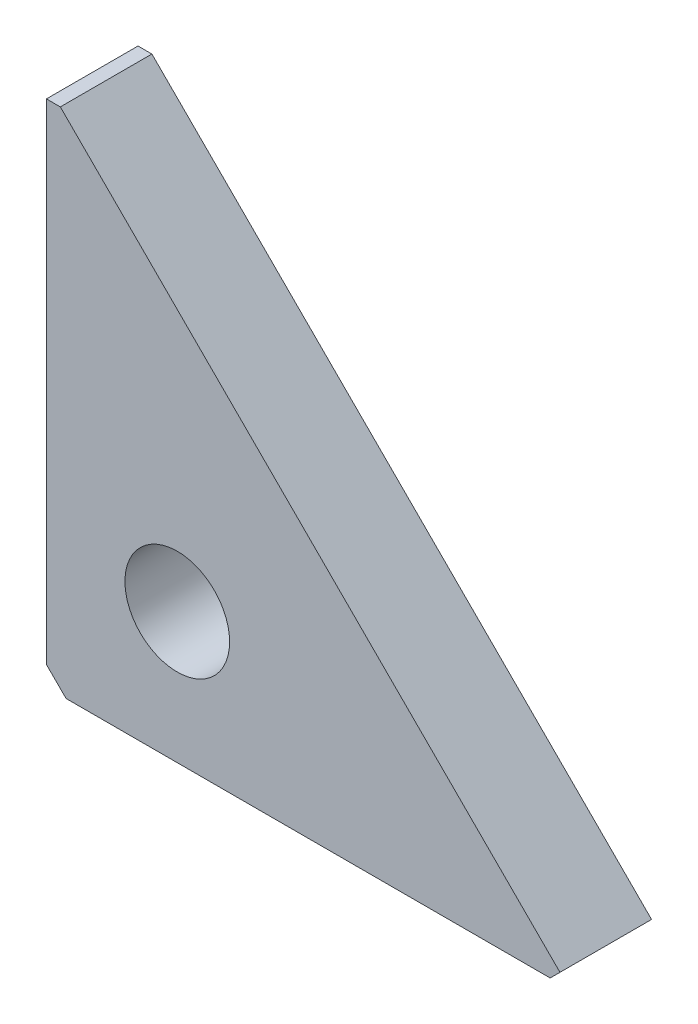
ISO-10303-21;
HEADER;
FILE_DESCRIPTION(('STEP AP214'),'2;1');
FILE_NAME('part.step','',(''),(''),'','','');
FILE_SCHEMA(('AUTOMOTIVE_DESIGN { 1 0 10303 214 1 1 1 1 }'));
ENDSEC;
DATA;
#1=APPLICATION_CONTEXT('core data for automotive mechanical design processes');
#2=APPLICATION_PROTOCOL_DEFINITION('international standard','automotive_design',2000,#1);
#3=PRODUCT_CONTEXT('',#1,'mechanical');
#4=PRODUCT('Part','Part','',(#3));
#5=PRODUCT_RELATED_PRODUCT_CATEGORY('part','',(#4));
#6=PRODUCT_DEFINITION_FORMATION('','',#4);
#7=PRODUCT_DEFINITION_CONTEXT('part definition',#1,'design');
#8=PRODUCT_DEFINITION('design','',#6,#7);
#9=PRODUCT_DEFINITION_SHAPE('','',#8);
#10=(LENGTH_UNIT() NAMED_UNIT(*) SI_UNIT(.MILLI.,.METRE.));
#11=(NAMED_UNIT(*) PLANE_ANGLE_UNIT() SI_UNIT($,.RADIAN.));
#12=(NAMED_UNIT(*) SI_UNIT($,.STERADIAN.) SOLID_ANGLE_UNIT());
#13=UNCERTAINTY_MEASURE_WITH_UNIT(LENGTH_MEASURE(1.E-05),#10,'distance_accuracy_value','');
#14=(GEOMETRIC_REPRESENTATION_CONTEXT(3) GLOBAL_UNCERTAINTY_ASSIGNED_CONTEXT((#13)) GLOBAL_UNIT_ASSIGNED_CONTEXT((#10,
#11,#12)) REPRESENTATION_CONTEXT('',''));
#15=CARTESIAN_POINT('',(0.,0.,0.));
#16=DIRECTION('',(0.,0.,1.));
#17=DIRECTION('',(1.,0.,0.));
#18=AXIS2_PLACEMENT_3D('',#15,#16,#17);
#19=CARTESIAN_POINT('',(80.,-80.,14.));
#20=DIRECTION('',(-0.707106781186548,-0.707106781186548,0.));
#21=DIRECTION('',(0.707106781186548,-0.707106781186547,0.));
#22=AXIS2_PLACEMENT_3D('',#19,#20,#21);
#23=PLANE('',#22);
#24=DIRECTION('',(-0.707106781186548,0.707106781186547,0.));
#25=VECTOR('',#24,1.);
#26=CARTESIAN_POINT('',(80.,-80.,14.));
#27=LINE('',#26,#25);
#28=CARTESIAN_POINT('',(78.5,-78.5,14.));
#29=VERTEX_POINT('',#28);
#30=CARTESIAN_POINT('',(2.12132034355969,-2.12132034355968,14.));
#31=VERTEX_POINT('',#30);
#32=EDGE_CURVE('E113',#29,#31,#27,.T.);
#33=ORIENTED_EDGE('',*,*,#32,.F.);
#34=DIRECTION('',(0.,0.,-1.));
#35=VECTOR('',#34,1.);
#36=CARTESIAN_POINT('',(78.5,-78.5,14.));
#37=LINE('',#36,#35);
#38=CARTESIAN_POINT('',(78.5,-78.5,0.));
#39=VERTEX_POINT('',#38);
#40=EDGE_CURVE('E11',#29,#39,#37,.T.);
#41=ORIENTED_EDGE('',*,*,#40,.T.);
#42=DIRECTION('',(-0.707106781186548,0.707106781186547,0.));
#43=VECTOR('',#42,1.);
#44=CARTESIAN_POINT('',(80.,-80.,0.));
#45=LINE('',#44,#43);
#46=CARTESIAN_POINT('',(2.12132034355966,-2.12132034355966,0.));
#47=VERTEX_POINT('',#46);
#48=EDGE_CURVE('E118',#39,#47,#45,.T.);
#49=ORIENTED_EDGE('',*,*,#48,.T.);
#50=DIRECTION('',(0.,0.,1.));
#51=VECTOR('',#50,1.);
#52=CARTESIAN_POINT('',(2.12132034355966,-2.12132034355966,14.));
#53=LINE('',#52,#51);
#54=EDGE_CURVE('E42',#47,#31,#53,.T.);
#55=ORIENTED_EDGE('',*,*,#54,.T.);
#56=EDGE_LOOP('',(#33,#41,#49,#55));
#57=FACE_BOUND('',#56,.T.);
#58=ADVANCED_FACE('F34',(#57),#23,.F.);
#59=CARTESIAN_POINT('',(0.,0.,14.));
#60=DIRECTION('',(1.,0.,0.));
#61=DIRECTION('',(0.,1.,0.));
#62=AXIS2_PLACEMENT_3D('',#59,#60,#61);
#63=PLANE('',#62);
#64=DIRECTION('',(0.,-1.,0.));
#65=VECTOR('',#64,1.);
#66=CARTESIAN_POINT('',(0.,0.,0.));
#67=LINE('',#66,#65);
#68=CARTESIAN_POINT('',(0.,-2.12132034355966,0.));
#69=VERTEX_POINT('',#68);
#70=CARTESIAN_POINT('',(0.,-77.,0.));
#71=VERTEX_POINT('',#70);
#72=EDGE_CURVE('E114',#69,#71,#67,.T.);
#73=ORIENTED_EDGE('',*,*,#72,.T.);
#74=DIRECTION('',(0.,0.,1.));
#75=VECTOR('',#74,1.);
#76=CARTESIAN_POINT('',(0.,-77.,14.));
#77=LINE('',#76,#75);
#78=CARTESIAN_POINT('',(0.,-77.,14.));
#79=VERTEX_POINT('',#78);
#80=EDGE_CURVE('E93',#71,#79,#77,.T.);
#81=ORIENTED_EDGE('',*,*,#80,.T.);
#82=DIRECTION('',(0.,-1.,0.));
#83=VECTOR('',#82,1.);
#84=CARTESIAN_POINT('',(0.,0.,14.));
#85=LINE('',#84,#83);
#86=CARTESIAN_POINT('',(0.,-2.12132034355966,14.));
#87=VERTEX_POINT('',#86);
#88=EDGE_CURVE('E116',#87,#79,#85,.T.);
#89=ORIENTED_EDGE('',*,*,#88,.F.);
#90=DIRECTION('',(0.,0.,-1.));
#91=VECTOR('',#90,1.);
#92=CARTESIAN_POINT('',(0.,-2.12132034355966,14.));
#93=LINE('',#92,#91);
#94=EDGE_CURVE('E98',#87,#69,#93,.T.);
#95=ORIENTED_EDGE('',*,*,#94,.T.);
#96=EDGE_LOOP('',(#73,#81,#89,#95));
#97=FACE_BOUND('',#96,.T.);
#98=ADVANCED_FACE('F159',(#97),#63,.F.);
#99=CARTESIAN_POINT('',(0.,-80.,14.));
#100=DIRECTION('',(0.,1.,0.));
#101=DIRECTION('',(0.,0.,1.));
#102=AXIS2_PLACEMENT_3D('',#99,#100,#101);
#103=PLANE('',#102);
#104=DIRECTION('',(1.,0.,0.));
#105=VECTOR('',#104,1.);
#106=CARTESIAN_POINT('',(0.,-80.,14.));
#107=LINE('',#106,#105);
#108=CARTESIAN_POINT('',(3.00000000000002,-80.,14.));
#109=VERTEX_POINT('',#108);
#110=CARTESIAN_POINT('',(77.,-80.,14.));
#111=VERTEX_POINT('',#110);
#112=EDGE_CURVE('E107',#109,#111,#107,.T.);
#113=ORIENTED_EDGE('',*,*,#112,.F.);
#114=DIRECTION('',(0.,0.,-1.));
#115=VECTOR('',#114,1.);
#116=CARTESIAN_POINT('',(3.,-80.,14.));
#117=LINE('',#116,#115);
#118=CARTESIAN_POINT('',(3.,-80.,0.));
#119=VERTEX_POINT('',#118);
#120=EDGE_CURVE('E92',#109,#119,#117,.T.);
#121=ORIENTED_EDGE('',*,*,#120,.T.);
#122=DIRECTION('',(1.,0.,0.));
#123=VECTOR('',#122,1.);
#124=CARTESIAN_POINT('',(0.,-80.,0.));
#125=LINE('',#124,#123);
#126=CARTESIAN_POINT('',(77.,-80.,0.));
#127=VERTEX_POINT('',#126);
#128=EDGE_CURVE('E105',#119,#127,#125,.T.);
#129=ORIENTED_EDGE('',*,*,#128,.T.);
#130=DIRECTION('',(0.,0.,1.));
#131=VECTOR('',#130,1.);
#132=CARTESIAN_POINT('',(77.,-80.,14.));
#133=LINE('',#132,#131);
#134=EDGE_CURVE('E109',#127,#111,#133,.T.);
#135=ORIENTED_EDGE('',*,*,#134,.T.);
#136=EDGE_LOOP('',(#113,#121,#129,#135));
#137=FACE_BOUND('',#136,.T.);
#138=ADVANCED_FACE('F104',(#137),#103,.F.);
#139=CARTESIAN_POINT('',(0.,0.,14.));
#140=DIRECTION('',(0.,0.,1.));
#141=DIRECTION('',(1.,0.,0.));
#142=AXIS2_PLACEMENT_3D('',#139,#140,#141);
#143=PLANE('',#142);
#144=CARTESIAN_POINT('',(20.,-60.,14.));
#145=DIRECTION('',(0.,0.,1.));
#146=DIRECTION('',(1.,0.,0.));
#147=AXIS2_PLACEMENT_3D('',#144,#145,#146);
#148=CIRCLE('',#147,8.);
#149=CARTESIAN_POINT('',(28.,-60.,14.));
#150=VERTEX_POINT('',#149);
#151=EDGE_CURVE('E143',#150,#150,#148,.T.);
#152=ORIENTED_EDGE('',*,*,#151,.F.);
#153=EDGE_LOOP('',(#152));
#154=FACE_BOUND('',#153,.T.);
#155=ORIENTED_EDGE('',*,*,#88,.T.);
#156=DIRECTION('',(-0.707106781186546,0.707106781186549,0.));
#157=VECTOR('',#156,1.);
#158=CARTESIAN_POINT('',(-38.5,-38.4999999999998,14.));
#159=LINE('',#158,#157);
#160=EDGE_CURVE('E131',#79,#109,#159,.F.);
#161=ORIENTED_EDGE('',*,*,#160,.T.);
#162=ORIENTED_EDGE('',*,*,#112,.T.);
#163=DIRECTION('',(-0.707106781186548,-0.707106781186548,0.));
#164=VECTOR('',#163,1.);
#165=CARTESIAN_POINT('',(78.5,-78.5,14.));
#166=LINE('',#165,#164);
#167=EDGE_CURVE('E55',#111,#29,#166,.F.);
#168=ORIENTED_EDGE('',*,*,#167,.T.);
#169=ORIENTED_EDGE('',*,*,#32,.T.);
#170=DIRECTION('',(1.,0.,0.));
#171=VECTOR('',#170,1.);
#172=CARTESIAN_POINT('',(0.,-2.12132034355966,14.));
#173=LINE('',#172,#171);
#174=EDGE_CURVE('E128',#31,#87,#173,.F.);
#175=ORIENTED_EDGE('',*,*,#174,.T.);
#176=EDGE_LOOP('',(#155,#161,#162,#168,#169,#175));
#177=FACE_BOUND('',#176,.T.);
#178=ADVANCED_FACE('F133',(#154,#177),#143,.T.);
#179=CARTESIAN_POINT('',(0.,0.,0.));
#180=DIRECTION('',(0.,0.,1.));
#181=DIRECTION('',(1.,0.,0.));
#182=AXIS2_PLACEMENT_3D('',#179,#180,#181);
#183=PLANE('',#182);
#184=CARTESIAN_POINT('',(20.,-60.,0.));
#185=DIRECTION('',(0.,0.,1.));
#186=DIRECTION('',(1.,0.,0.));
#187=AXIS2_PLACEMENT_3D('',#184,#185,#186);
#188=CIRCLE('',#187,8.);
#189=CARTESIAN_POINT('',(28.,-60.,0.));
#190=VERTEX_POINT('',#189);
#191=EDGE_CURVE('E141',#190,#190,#188,.T.);
#192=ORIENTED_EDGE('',*,*,#191,.T.);
#193=EDGE_LOOP('',(#192));
#194=FACE_BOUND('',#193,.T.);
#195=ORIENTED_EDGE('',*,*,#128,.F.);
#196=DIRECTION('',(0.707106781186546,-0.707106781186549,0.));
#197=VECTOR('',#196,1.);
#198=CARTESIAN_POINT('',(3.,-80.,0.));
#199=LINE('',#198,#197);
#200=EDGE_CURVE('E88',#119,#71,#199,.F.);
#201=ORIENTED_EDGE('',*,*,#200,.T.);
#202=ORIENTED_EDGE('',*,*,#72,.F.);
#203=DIRECTION('',(-1.,0.,0.));
#204=VECTOR('',#203,1.);
#205=CARTESIAN_POINT('',(0.,-2.12132034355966,0.));
#206=LINE('',#205,#204);
#207=EDGE_CURVE('E108',#69,#47,#206,.F.);
#208=ORIENTED_EDGE('',*,*,#207,.T.);
#209=ORIENTED_EDGE('',*,*,#48,.F.);
#210=DIRECTION('',(0.707106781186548,0.707106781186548,0.));
#211=VECTOR('',#210,1.);
#212=CARTESIAN_POINT('',(78.5,-78.5,0.));
#213=LINE('',#212,#211);
#214=EDGE_CURVE('E99',#39,#127,#213,.F.);
#215=ORIENTED_EDGE('',*,*,#214,.T.);
#216=EDGE_LOOP('',(#195,#201,#202,#208,#209,#215));
#217=FACE_BOUND('',#216,.T.);
#218=ADVANCED_FACE('F111',(#194,#217),#183,.F.);
#219=CARTESIAN_POINT('',(3.,-80.,14.));
#220=DIRECTION('',(0.707106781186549,0.707106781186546,0.));
#221=DIRECTION('',(-0.707106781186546,0.707106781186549,0.));
#222=AXIS2_PLACEMENT_3D('',#219,#220,#221);
#223=PLANE('',#222);
#224=ORIENTED_EDGE('',*,*,#160,.F.);
#225=ORIENTED_EDGE('',*,*,#80,.F.);
#226=ORIENTED_EDGE('',*,*,#200,.F.);
#227=ORIENTED_EDGE('',*,*,#120,.F.);
#228=EDGE_LOOP('',(#224,#225,#226,#227));
#229=FACE_BOUND('',#228,.T.);
#230=ADVANCED_FACE('F91',(#229),#223,.F.);
#231=CARTESIAN_POINT('',(78.5,-78.5,14.));
#232=DIRECTION('',(-0.707106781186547,0.707106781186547,0.));
#233=DIRECTION('',(-0.707106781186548,-0.707106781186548,0.));
#234=AXIS2_PLACEMENT_3D('',#231,#232,#233);
#235=PLANE('',#234);
#236=ORIENTED_EDGE('',*,*,#167,.F.);
#237=ORIENTED_EDGE('',*,*,#134,.F.);
#238=ORIENTED_EDGE('',*,*,#214,.F.);
#239=ORIENTED_EDGE('',*,*,#40,.F.);
#240=EDGE_LOOP('',(#236,#237,#238,#239));
#241=FACE_BOUND('',#240,.T.);
#242=ADVANCED_FACE('F170',(#241),#235,.F.);
#243=CARTESIAN_POINT('',(0.,-2.12132034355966,14.));
#244=DIRECTION('',(0.,-1.,0.));
#245=DIRECTION('',(1.,0.,0.));
#246=AXIS2_PLACEMENT_3D('',#243,#244,#245);
#247=PLANE('',#246);
#248=ORIENTED_EDGE('',*,*,#174,.F.);
#249=ORIENTED_EDGE('',*,*,#54,.F.);
#250=ORIENTED_EDGE('',*,*,#207,.F.);
#251=ORIENTED_EDGE('',*,*,#94,.F.);
#252=EDGE_LOOP('',(#248,#249,#250,#251));
#253=FACE_BOUND('',#252,.T.);
#254=ADVANCED_FACE('F36',(#253),#247,.F.);
#255=CARTESIAN_POINT('',(20.,-60.,0.));
#256=DIRECTION('',(0.,0.,1.));
#257=DIRECTION('',(1.,0.,0.));
#258=AXIS2_PLACEMENT_3D('',#255,#256,#257);
#259=CYLINDRICAL_SURFACE('',#258,8.);
#260=ORIENTED_EDGE('',*,*,#191,.F.);
#261=EDGE_LOOP('',(#260));
#262=FACE_BOUND('',#261,.T.);
#263=ORIENTED_EDGE('',*,*,#151,.T.);
#264=EDGE_LOOP('',(#263));
#265=FACE_BOUND('',#264,.T.);
#266=ADVANCED_FACE('F150',(#262,#265),#259,.F.);
#267=CLOSED_SHELL('',(#58,#98,#138,#178,#218,#230,#242,#254,#266));
#268=MANIFOLD_SOLID_BREP('B2',#267);
#269=ADVANCED_BREP_SHAPE_REPRESENTATION('',(#18,#268),#14);
#270=SHAPE_DEFINITION_REPRESENTATION(#9,#269);
ENDSEC;
END-ISO-10303-21;
